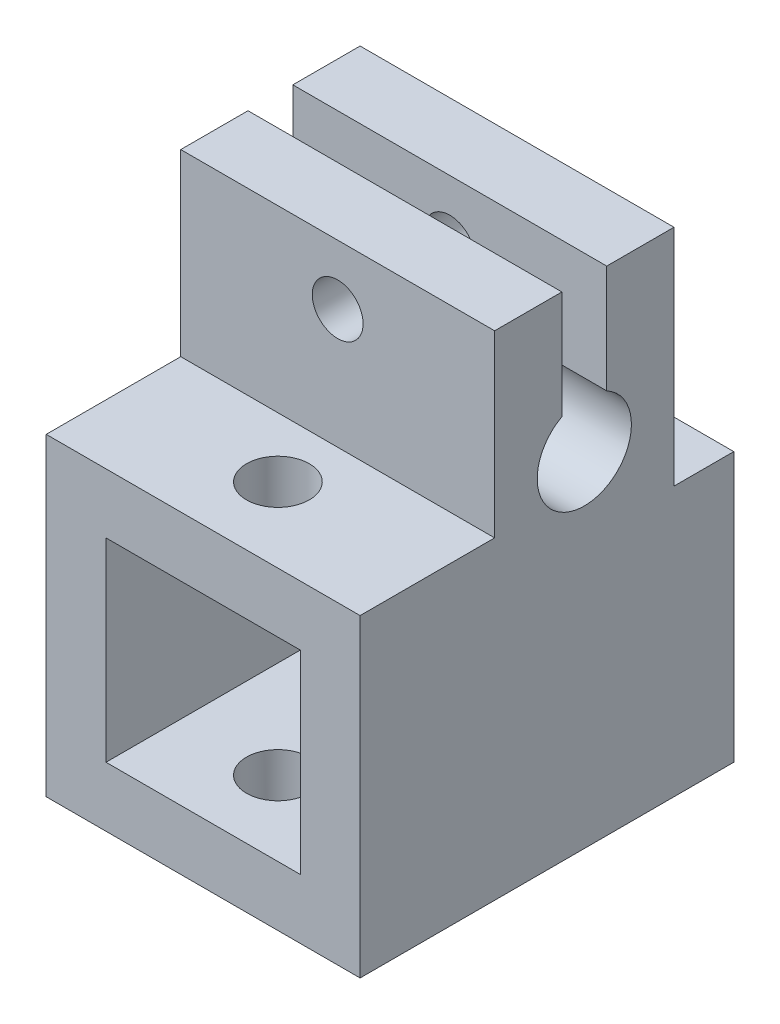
from build123d import *

# Parameters (mm, degrees)
SKETCH_2_W                   = 15
SKETCH_2_H                   = 15
EXTRUDE_1_DEPTH              = 25
SKETCH_3_W                   = 13
SKETCH_3_H                   = 13
CUT_EXTRUDE_1_DEPTH          = 20
SKETCH_6_W                   = 15
SKETCH_6_H                   = 15
EXTRUDE_2_DEPTH              = 15
SKETCH_7_R                   = 3.15
CUT_EXTRUDE_2_DEPTH          = 15
SKETCH_8_W                   = 15
SKETCH_8_H                   = 3
CUT_EXTRUDE_3_DEPTH          = 15
SKETCH_12_W                  = 3
SKETCH_12_H                  = 10.198909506
CUT_EXTRUDE_5_DEPTH          = 15
SKETCH_15_W                  = 15
SKETCH_15_H                  = 15
CUT_EXTRUDE_6_DEPTH          = 1
SKETCH_16_W                  = 15
SKETCH_16_H                  = 15
EXTRUDE_3_DEPTH              = 1
HOLE_WIZARD_M3_1_D           = 3.4
HOLE_WIZARD_M3_1_CSINK_D     = 6.6
HOLE_WIZARD_M3_1_CSINK_ANGLE = 90
SKETCH_19_W                  = 15
SKETCH_19_H                  = 9
EXTRUDE_4_DEPTH              = 3
SKETCH_20_W                  = 15
SKETCH_20_H                  = 25
EXTRUDE_5_DEPTH              = 3
EXTRUDE_6_DEPTH              = 3
EXTRUDE_START                = 3
EXTRUDE_7_DEPTH              = 3
HOLE_WIZARD_M5_1_D           = 4.2


with BuildPart() as part:
    # Sketch 2 → Extrude 1 (new body)
    with BuildSketch(Plane.XY):
        Rectangle(SKETCH_2_W, SKETCH_2_H)
    extrude(amount=EXTRUDE_1_DEPTH)

    # Sketch 3 → Cut-Extrude 1 (cut)
    with BuildSketch(Plane.XY.offset(25)):
        Rectangle(SKETCH_3_W, SKETCH_3_H)
    extrude(amount=-CUT_EXTRUDE_1_DEPTH, mode=Mode.SUBTRACT)

    # Sketch 6 → Extrude 2 (add)
    with BuildSketch(Plane(origin=(0, 7.5, 0), x_dir=(1, 0, 0), z_dir=(0, 1, 0))):
        with Locations((0, -7.5)):
            Rectangle(SKETCH_6_W, SKETCH_6_H)
    extrude(amount=EXTRUDE_2_DEPTH)

    # Sketch 7 → Cut-Extrude 2 (cut)
    with BuildSketch(Plane(origin=(7.5, 0, 0), x_dir=(0, 0, -1), z_dir=(1, 0, 0))):
        with Locations(Location((-10, 12.5, 0), (0, 0, 90))):
            Circle(SKETCH_7_R)
    extrude(amount=-CUT_EXTRUDE_2_DEPTH, mode=Mode.SUBTRACT)

    # Sketch 8 → Cut-Extrude 3 (cut)
    with BuildSketch(Plane(origin=(0, 22.5, 0), x_dir=(1, 0, 0), z_dir=(0, 1, 0))):
        with Locations((0, -1.5)):
            Rectangle(SKETCH_8_W, SKETCH_8_H)
    extrude(amount=-CUT_EXTRUDE_3_DEPTH, mode=Mode.SUBTRACT)

    # Sketch 12 → Cut-Extrude 5 (cut)
    with BuildSketch(Plane(origin=(7.5, 0, 0), x_dir=(0, 0, -1), z_dir=(1, 0, 0))):
        with Locations((-10, 18.153575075)):
            Rectangle(SKETCH_12_W, SKETCH_12_H)
    extrude(amount=-CUT_EXTRUDE_5_DEPTH, mode=Mode.SUBTRACT)

    # Sketch 15 → Cut-Extrude 6 (cut)
    with BuildSketch(Plane(origin=(0, 0, 3), x_dir=(-1, 0, 0), z_dir=(0, 0, -1))):
        with Locations((0, 15)):
            Rectangle(SKETCH_15_W, SKETCH_15_H)
    extrude(amount=-CUT_EXTRUDE_6_DEPTH, mode=Mode.SUBTRACT)

    # Sketch 16 → Extrude 3 (add)
    with BuildSketch(Plane.XY.offset(15)):
        with Locations((0, 15)):
            Rectangle(SKETCH_16_W, SKETCH_16_H)
    extrude(amount=EXTRUDE_3_DEPTH)

    # Hole Wizard M3 _1 (through all)
    with Locations(Plane(origin=(0, 0, 4), x_dir=(-1, 0, 0), z_dir=(0, 0, -1))):
        with Locations((0, 18.5)):
            CounterSinkHole(HOLE_WIZARD_M3_1_D / 2, HOLE_WIZARD_M3_1_CSINK_D / 2, counter_sink_angle=HOLE_WIZARD_M3_1_CSINK_ANGLE)

    # Sketch 19 → Extrude 4 (add)
    with BuildSketch(Plane(origin=(0, 7.5, 0), x_dir=(1, 0, 0), z_dir=(0, 1, 0))):
        with Locations((0, -20.5)):
            Rectangle(SKETCH_19_W, SKETCH_19_H)
    extrude(amount=EXTRUDE_4_DEPTH)

    # Sketch 20 → Extrude 5 (add)
    with BuildSketch(Plane.XZ.offset(7.5)):
        with Locations((0, 12.5)):
            Rectangle(SKETCH_20_W, SKETCH_20_H)
    extrude(amount=EXTRUDE_5_DEPTH)

    # Sketch 21 → Extrude 6 (add)
    with BuildSketch(Plane.ZY.offset(7.5)):
        with BuildLine():
            Line((4, 22.5), (4, 7.5))
            Line((4, 7.5), (0, 7.5))
            Line((0, 7.5), (0, -10.5))
            Line((0, -10.5), (25, -10.5))
            Line((25, -10.5), (25, 10.5))
            Line((25, 10.5), (16, 10.5))
            Line((16, 10.5), (16, 22.5))
            Line((16, 22.5), (11.5, 22.5))
            Line((11.5, 22.5), (11.5, 15.269927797))
            ThreePointArc((11.5, 15.269927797), (10, 9.35), (8.5, 15.269927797))
            Line((8.5, 15.269927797), (8.5, 22.5))
            Line((8.5, 22.5), (4, 22.5))
        make_face()
    extrude(amount=EXTRUDE_6_DEPTH)

    # Sketch 22 → Extrude 7 (add)
    with BuildSketch(Plane(origin=(7.5, 0, 0), x_dir=(0, 0, -1), z_dir=(1, 0, 0)).offset(EXTRUDE_START)):
        with BuildLine():
            Line((0, 7.5), (-4, 7.5))
            Line((-4, 7.5), (-4, 22.5))
            Line((-4, 22.5), (-8.5, 22.5))
            Line((-8.5, 22.5), (-8.5, 15.269927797))
            ThreePointArc((-8.5, 15.269927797), (-10, 9.35), (-11.5, 15.269927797))
            Line((-11.5, 15.269927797), (-11.5, 22.5))
            Line((-11.5, 22.5), (-16, 22.5))
            Line((-16, 22.5), (-16, 10.5))
            Line((-16, 10.5), (-25, 10.5))
            Line((-25, 10.5), (-25, -10.5))
            Line((-25, -10.5), (0, -10.5))
            Line((0, -10.5), (0, 7.5))
        make_face()
    extrude(amount=-EXTRUDE_7_DEPTH)

    # Hole Wizard M5 _1 (through all)
    with Locations(Plane(origin=(0, 10.5, 0), x_dir=(1, 0, 0), z_dir=(0, 1, 0))):
        with Locations((0, -20)):
            Hole(HOLE_WIZARD_M5_1_D / 2)


solid = part.part
